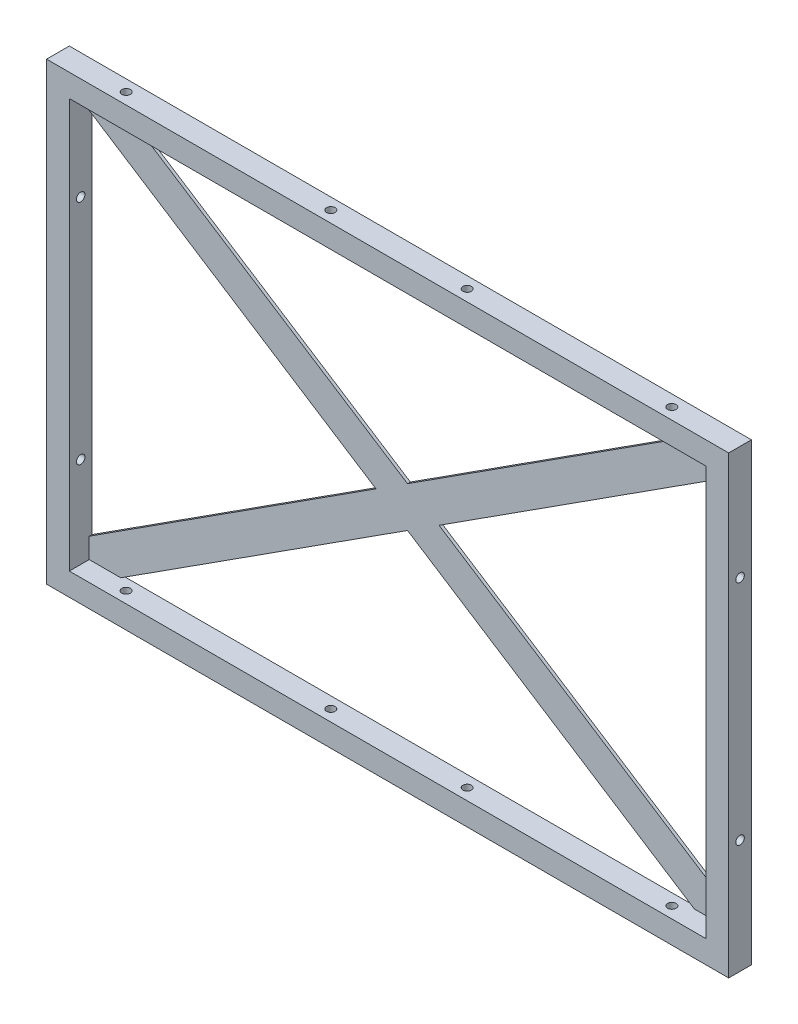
ISO-10303-21;
HEADER;
FILE_DESCRIPTION(('STEP AP214'),'2;1');
FILE_NAME('part.step','',(''),(''),'','','');
FILE_SCHEMA(('AUTOMOTIVE_DESIGN { 1 0 10303 214 1 1 1 1 }'));
ENDSEC;
DATA;
#1=APPLICATION_CONTEXT('core data for automotive mechanical design processes');
#2=APPLICATION_PROTOCOL_DEFINITION('international standard','automotive_design',2000,#1);
#3=PRODUCT_CONTEXT('',#1,'mechanical');
#4=PRODUCT('Part','Part','',(#3));
#5=PRODUCT_RELATED_PRODUCT_CATEGORY('part','',(#4));
#6=PRODUCT_DEFINITION_FORMATION('','',#4);
#7=PRODUCT_DEFINITION_CONTEXT('part definition',#1,'design');
#8=PRODUCT_DEFINITION('design','',#6,#7);
#9=PRODUCT_DEFINITION_SHAPE('','',#8);
#10=(LENGTH_UNIT() NAMED_UNIT(*) SI_UNIT(.MILLI.,.METRE.));
#11=(NAMED_UNIT(*) PLANE_ANGLE_UNIT() SI_UNIT($,.RADIAN.));
#12=(NAMED_UNIT(*) SI_UNIT($,.STERADIAN.) SOLID_ANGLE_UNIT());
#13=UNCERTAINTY_MEASURE_WITH_UNIT(LENGTH_MEASURE(1.E-05),#10,'distance_accuracy_value','');
#14=(GEOMETRIC_REPRESENTATION_CONTEXT(3) GLOBAL_UNCERTAINTY_ASSIGNED_CONTEXT((#13)) GLOBAL_UNIT_ASSIGNED_CONTEXT((#10,
#11,#12)) REPRESENTATION_CONTEXT('',''));
#15=CARTESIAN_POINT('',(0.,0.,0.));
#16=DIRECTION('',(0.,0.,1.));
#17=DIRECTION('',(1.,0.,0.));
#18=AXIS2_PLACEMENT_3D('',#15,#16,#17);
#19=CARTESIAN_POINT('',(381.000000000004,-253.999999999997,25.4));
#20=DIRECTION('',(0.,1.,0.));
#21=DIRECTION('',(0.,0.,1.));
#22=AXIS2_PLACEMENT_3D('',#19,#20,#21);
#23=PLANE('',#22);
#24=CARTESIAN_POINT('',(76.2,-253.999999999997,12.7));
#25=DIRECTION('',(0.,-1.,0.));
#26=DIRECTION('',(0.,0.,-1.));
#27=AXIS2_PLACEMENT_3D('',#24,#25,#26);
#28=CIRCLE('',#27,4.76249999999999);
#29=CARTESIAN_POINT('',(76.2,-253.999999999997,7.93750000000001));
#30=VERTEX_POINT('',#29);
#31=EDGE_CURVE('E299',#30,#30,#28,.T.);
#32=ORIENTED_EDGE('',*,*,#31,.F.);
#33=EDGE_LOOP('',(#32));
#34=FACE_BOUND('',#33,.T.);
#35=CARTESIAN_POINT('',(304.800000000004,-253.999999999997,12.7));
#36=DIRECTION('',(0.,-1.,0.));
#37=DIRECTION('',(0.,0.,-1.));
#38=AXIS2_PLACEMENT_3D('',#35,#36,#37);
#39=CIRCLE('',#38,4.7625);
#40=CARTESIAN_POINT('',(304.800000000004,-253.999999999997,7.9375));
#41=VERTEX_POINT('',#40);
#42=EDGE_CURVE('E288',#41,#41,#39,.T.);
#43=ORIENTED_EDGE('',*,*,#42,.F.);
#44=EDGE_LOOP('',(#43));
#45=FACE_BOUND('',#44,.T.);
#46=DIRECTION('',(1.,0.,0.));
#47=VECTOR('',#46,1.);
#48=CARTESIAN_POINT('',(381.000000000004,-253.999999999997,0.));
#49=LINE('',#48,#47);
#50=CARTESIAN_POINT('',(-381.000000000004,-253.999999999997,0.));
#51=VERTEX_POINT('',#50);
#52=CARTESIAN_POINT('',(381.000000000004,-253.999999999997,0.));
#53=VERTEX_POINT('',#52);
#54=EDGE_CURVE('E394',#51,#53,#49,.T.);
#55=ORIENTED_EDGE('',*,*,#54,.T.);
#56=DIRECTION('',(0.,0.,-1.));
#57=VECTOR('',#56,1.);
#58=CARTESIAN_POINT('',(381.000000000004,-253.999999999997,25.4));
#59=LINE('',#58,#57);
#60=CARTESIAN_POINT('',(381.000000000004,-253.999999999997,25.4));
#61=VERTEX_POINT('',#60);
#62=EDGE_CURVE('E380',#61,#53,#59,.T.);
#63=ORIENTED_EDGE('',*,*,#62,.F.);
#64=DIRECTION('',(1.,0.,0.));
#65=VECTOR('',#64,1.);
#66=CARTESIAN_POINT('',(381.000000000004,-253.999999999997,25.4));
#67=LINE('',#66,#65);
#68=CARTESIAN_POINT('',(-381.000000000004,-253.999999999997,25.4));
#69=VERTEX_POINT('',#68);
#70=EDGE_CURVE('E400',#69,#61,#67,.T.);
#71=ORIENTED_EDGE('',*,*,#70,.F.);
#72=DIRECTION('',(0.,0.,-1.));
#73=VECTOR('',#72,1.);
#74=CARTESIAN_POINT('',(-381.000000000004,-253.999999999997,25.4));
#75=LINE('',#74,#73);
#76=EDGE_CURVE('E358',#69,#51,#75,.T.);
#77=ORIENTED_EDGE('',*,*,#76,.T.);
#78=EDGE_LOOP('',(#55,#63,#71,#77));
#79=FACE_BOUND('',#78,.T.);
#80=CARTESIAN_POINT('',(-304.800000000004,-253.999999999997,12.7));
#81=DIRECTION('',(0.,-1.,0.));
#82=DIRECTION('',(0.,0.,-1.));
#83=AXIS2_PLACEMENT_3D('',#80,#81,#82);
#84=CIRCLE('',#83,4.7625);
#85=CARTESIAN_POINT('',(-304.800000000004,-253.999999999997,7.9375));
#86=VERTEX_POINT('',#85);
#87=EDGE_CURVE('E304',#86,#86,#84,.T.);
#88=ORIENTED_EDGE('',*,*,#87,.F.);
#89=EDGE_LOOP('',(#88));
#90=FACE_BOUND('',#89,.T.);
#91=CARTESIAN_POINT('',(-76.2,-253.999999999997,12.7));
#92=DIRECTION('',(0.,-1.,0.));
#93=DIRECTION('',(0.,0.,-1.));
#94=AXIS2_PLACEMENT_3D('',#91,#92,#93);
#95=CIRCLE('',#94,4.76249999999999);
#96=CARTESIAN_POINT('',(-76.2,-253.999999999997,7.93750000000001));
#97=VERTEX_POINT('',#96);
#98=EDGE_CURVE('E287',#97,#97,#95,.T.);
#99=ORIENTED_EDGE('',*,*,#98,.F.);
#100=EDGE_LOOP('',(#99));
#101=FACE_BOUND('',#100,.T.);
#102=ADVANCED_FACE('F39',(#34,#45,#79,#90,#101),#23,.F.);
#103=CARTESIAN_POINT('',(381.000000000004,253.999999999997,25.4));
#104=DIRECTION('',(0.,-1.,0.));
#105=DIRECTION('',(0.,0.,-1.));
#106=AXIS2_PLACEMENT_3D('',#103,#104,#105);
#107=PLANE('',#106);
#108=DIRECTION('',(-1.,0.,0.));
#109=VECTOR('',#108,1.);
#110=CARTESIAN_POINT('',(381.000000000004,253.999999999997,0.));
#111=LINE('',#110,#109);
#112=CARTESIAN_POINT('',(381.000000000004,253.999999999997,0.));
#113=VERTEX_POINT('',#112);
#114=CARTESIAN_POINT('',(-381.000000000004,253.999999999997,0.));
#115=VERTEX_POINT('',#114);
#116=EDGE_CURVE('E390',#113,#115,#111,.T.);
#117=ORIENTED_EDGE('',*,*,#116,.T.);
#118=DIRECTION('',(0.,0.,-1.));
#119=VECTOR('',#118,1.);
#120=CARTESIAN_POINT('',(-381.000000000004,253.999999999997,25.4));
#121=LINE('',#120,#119);
#122=CARTESIAN_POINT('',(-381.000000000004,253.999999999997,25.4));
#123=VERTEX_POINT('',#122);
#124=EDGE_CURVE('E386',#123,#115,#121,.T.);
#125=ORIENTED_EDGE('',*,*,#124,.F.);
#126=DIRECTION('',(-1.,0.,0.));
#127=VECTOR('',#126,1.);
#128=CARTESIAN_POINT('',(381.000000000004,253.999999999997,25.4));
#129=LINE('',#128,#127);
#130=CARTESIAN_POINT('',(381.000000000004,253.999999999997,25.4));
#131=VERTEX_POINT('',#130);
#132=EDGE_CURVE('E389',#131,#123,#129,.T.);
#133=ORIENTED_EDGE('',*,*,#132,.F.);
#134=DIRECTION('',(0.,0.,-1.));
#135=VECTOR('',#134,1.);
#136=CARTESIAN_POINT('',(381.000000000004,253.999999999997,25.4));
#137=LINE('',#136,#135);
#138=EDGE_CURVE('E383',#131,#113,#137,.T.);
#139=ORIENTED_EDGE('',*,*,#138,.T.);
#140=EDGE_LOOP('',(#117,#125,#133,#139));
#141=FACE_BOUND('',#140,.T.);
#142=CARTESIAN_POINT('',(-304.800000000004,253.999999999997,12.7));
#143=DIRECTION('',(0.,1.,0.));
#144=DIRECTION('',(0.,0.,1.));
#145=AXIS2_PLACEMENT_3D('',#142,#143,#144);
#146=CIRCLE('',#145,4.7625);
#147=CARTESIAN_POINT('',(-304.800000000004,253.999999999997,17.4625));
#148=VERTEX_POINT('',#147);
#149=EDGE_CURVE('E328',#148,#148,#146,.T.);
#150=ORIENTED_EDGE('',*,*,#149,.F.);
#151=EDGE_LOOP('',(#150));
#152=FACE_BOUND('',#151,.T.);
#153=CARTESIAN_POINT('',(-76.2,253.999999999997,12.7));
#154=DIRECTION('',(0.,1.,0.));
#155=DIRECTION('',(0.,0.,1.));
#156=AXIS2_PLACEMENT_3D('',#153,#154,#155);
#157=CIRCLE('',#156,4.76249999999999);
#158=CARTESIAN_POINT('',(-76.2,253.999999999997,17.4625));
#159=VERTEX_POINT('',#158);
#160=EDGE_CURVE('E322',#159,#159,#157,.T.);
#161=ORIENTED_EDGE('',*,*,#160,.F.);
#162=EDGE_LOOP('',(#161));
#163=FACE_BOUND('',#162,.T.);
#164=CARTESIAN_POINT('',(304.800000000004,253.999999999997,12.7));
#165=DIRECTION('',(0.,1.,0.));
#166=DIRECTION('',(0.,0.,1.));
#167=AXIS2_PLACEMENT_3D('',#164,#165,#166);
#168=CIRCLE('',#167,4.7625);
#169=CARTESIAN_POINT('',(304.800000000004,253.999999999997,17.4625));
#170=VERTEX_POINT('',#169);
#171=EDGE_CURVE('E316',#170,#170,#168,.T.);
#172=ORIENTED_EDGE('',*,*,#171,.F.);
#173=EDGE_LOOP('',(#172));
#174=FACE_BOUND('',#173,.T.);
#175=CARTESIAN_POINT('',(76.2,253.999999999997,12.7));
#176=DIRECTION('',(0.,1.,0.));
#177=DIRECTION('',(0.,0.,1.));
#178=AXIS2_PLACEMENT_3D('',#175,#176,#177);
#179=CIRCLE('',#178,4.76249999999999);
#180=CARTESIAN_POINT('',(76.2,253.999999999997,17.4625));
#181=VERTEX_POINT('',#180);
#182=EDGE_CURVE('E310',#181,#181,#179,.T.);
#183=ORIENTED_EDGE('',*,*,#182,.F.);
#184=EDGE_LOOP('',(#183));
#185=FACE_BOUND('',#184,.T.);
#186=ADVANCED_FACE('F421',(#141,#152,#163,#174,#185),#107,.F.);
#187=CARTESIAN_POINT('',(355.6,228.6,25.4));
#188=DIRECTION('',(0.,-1.,0.));
#189=DIRECTION('',(0.,0.,-1.));
#190=AXIS2_PLACEMENT_3D('',#187,#188,#189);
#191=PLANE('',#190);
#192=CARTESIAN_POINT('',(304.800000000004,228.6,12.7));
#193=DIRECTION('',(0.,-1.,0.));
#194=DIRECTION('',(0.,0.,-1.));
#195=AXIS2_PLACEMENT_3D('',#192,#193,#194);
#196=CIRCLE('',#195,4.7625);
#197=CARTESIAN_POINT('',(304.800000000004,228.6,7.9375));
#198=VERTEX_POINT('',#197);
#199=EDGE_CURVE('E319',#198,#198,#196,.F.);
#200=ORIENTED_EDGE('',*,*,#199,.T.);
#201=EDGE_LOOP('',(#200));
#202=FACE_BOUND('',#201,.T.);
#203=CARTESIAN_POINT('',(-304.800000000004,228.6,12.7));
#204=DIRECTION('',(0.,-1.,0.));
#205=DIRECTION('',(0.,0.,-1.));
#206=AXIS2_PLACEMENT_3D('',#203,#204,#205);
#207=CIRCLE('',#206,4.76249999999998);
#208=CARTESIAN_POINT('',(-304.800000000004,228.6,7.93750000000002));
#209=VERTEX_POINT('',#208);
#210=EDGE_CURVE('E331',#209,#209,#207,.F.);
#211=ORIENTED_EDGE('',*,*,#210,.T.);
#212=EDGE_LOOP('',(#211));
#213=FACE_BOUND('',#212,.T.);
#214=DIRECTION('',(0.,0.,-1.));
#215=VECTOR('',#214,1.);
#216=CARTESIAN_POINT('',(320.371645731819,228.6,3.175));
#217=LINE('',#216,#215);
#218=CARTESIAN_POINT('',(320.371645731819,228.6,3.175));
#219=VERTEX_POINT('',#218);
#220=CARTESIAN_POINT('',(320.371645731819,228.6,0.));
#221=VERTEX_POINT('',#220);
#222=EDGE_CURVE('E227',#219,#221,#217,.T.);
#223=ORIENTED_EDGE('',*,*,#222,.F.);
#224=DIRECTION('',(1.,0.,0.));
#225=VECTOR('',#224,1.);
#226=CARTESIAN_POINT('',(0.,228.6,3.175));
#227=LINE('',#226,#225);
#228=CARTESIAN_POINT('',(355.6,228.6,3.175));
#229=VERTEX_POINT('',#228);
#230=EDGE_CURVE('E187',#219,#229,#227,.T.);
#231=ORIENTED_EDGE('',*,*,#230,.T.);
#232=DIRECTION('',(0.,0.,-1.));
#233=VECTOR('',#232,1.);
#234=CARTESIAN_POINT('',(355.6,228.6,25.4));
#235=LINE('',#234,#233);
#236=CARTESIAN_POINT('',(355.6,228.6,25.4));
#237=VERTEX_POINT('',#236);
#238=EDGE_CURVE('E178',#237,#229,#235,.T.);
#239=ORIENTED_EDGE('',*,*,#238,.F.);
#240=DIRECTION('',(-1.,0.,0.));
#241=VECTOR('',#240,1.);
#242=CARTESIAN_POINT('',(355.6,228.6,25.4));
#243=LINE('',#242,#241);
#244=CARTESIAN_POINT('',(-355.6,228.6,25.4));
#245=VERTEX_POINT('',#244);
#246=EDGE_CURVE('E185',#237,#245,#243,.T.);
#247=ORIENTED_EDGE('',*,*,#246,.T.);
#248=DIRECTION('',(0.,0.,-1.));
#249=VECTOR('',#248,1.);
#250=CARTESIAN_POINT('',(-355.6,228.6,25.4));
#251=LINE('',#250,#249);
#252=CARTESIAN_POINT('',(-355.6,228.6,3.175));
#253=VERTEX_POINT('',#252);
#254=EDGE_CURVE('E189',#245,#253,#251,.T.);
#255=ORIENTED_EDGE('',*,*,#254,.T.);
#256=DIRECTION('',(1.,0.,0.));
#257=VECTOR('',#256,1.);
#258=CARTESIAN_POINT('',(0.,228.6,3.175));
#259=LINE('',#258,#257);
#260=CARTESIAN_POINT('',(-320.371645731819,228.6,3.175));
#261=VERTEX_POINT('',#260);
#262=EDGE_CURVE('E48',#253,#261,#259,.T.);
#263=ORIENTED_EDGE('',*,*,#262,.T.);
#264=DIRECTION('',(0.,0.,-1.));
#265=VECTOR('',#264,1.);
#266=CARTESIAN_POINT('',(-320.371645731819,228.6,3.175));
#267=LINE('',#266,#265);
#268=CARTESIAN_POINT('',(-320.371645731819,228.6,0.));
#269=VERTEX_POINT('',#268);
#270=EDGE_CURVE('E11',#261,#269,#267,.T.);
#271=ORIENTED_EDGE('',*,*,#270,.T.);
#272=DIRECTION('',(-1.,0.,0.));
#273=VECTOR('',#272,1.);
#274=CARTESIAN_POINT('',(355.6,228.6,0.));
#275=LINE('',#274,#273);
#276=EDGE_CURVE('E214',#221,#269,#275,.T.);
#277=ORIENTED_EDGE('',*,*,#276,.F.);
#278=EDGE_LOOP('',(#223,#231,#239,#247,#255,#263,#271,#277));
#279=FACE_BOUND('',#278,.T.);
#280=CARTESIAN_POINT('',(-76.2,228.6,12.7));
#281=DIRECTION('',(0.,-1.,0.));
#282=DIRECTION('',(0.,0.,-1.));
#283=AXIS2_PLACEMENT_3D('',#280,#281,#282);
#284=CIRCLE('',#283,4.76249999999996);
#285=CARTESIAN_POINT('',(-76.2,228.6,7.93750000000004));
#286=VERTEX_POINT('',#285);
#287=EDGE_CURVE('E325',#286,#286,#284,.F.);
#288=ORIENTED_EDGE('',*,*,#287,.T.);
#289=EDGE_LOOP('',(#288));
#290=FACE_BOUND('',#289,.T.);
#291=CARTESIAN_POINT('',(76.2,228.6,12.7));
#292=DIRECTION('',(0.,-1.,0.));
#293=DIRECTION('',(0.,0.,-1.));
#294=AXIS2_PLACEMENT_3D('',#291,#292,#293);
#295=CIRCLE('',#294,4.76249999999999);
#296=CARTESIAN_POINT('',(76.2,228.6,7.93750000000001));
#297=VERTEX_POINT('',#296);
#298=EDGE_CURVE('E313',#297,#297,#295,.F.);
#299=ORIENTED_EDGE('',*,*,#298,.T.);
#300=EDGE_LOOP('',(#299));
#301=FACE_BOUND('',#300,.T.);
#302=ADVANCED_FACE('F181',(#202,#213,#279,#290,#301),#191,.T.);
#303=CARTESIAN_POINT('',(381.000000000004,-253.999999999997,25.4));
#304=DIRECTION('',(-1.,0.,0.));
#305=DIRECTION('',(0.,0.,1.));
#306=AXIS2_PLACEMENT_3D('',#303,#304,#305);
#307=PLANE('',#306);
#308=DIRECTION('',(0.,1.,0.));
#309=VECTOR('',#308,1.);
#310=CARTESIAN_POINT('',(381.000000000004,-253.999999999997,0.));
#311=LINE('',#310,#309);
#312=EDGE_CURVE('E392',#53,#113,#311,.T.);
#313=ORIENTED_EDGE('',*,*,#312,.T.);
#314=ORIENTED_EDGE('',*,*,#138,.F.);
#315=DIRECTION('',(0.,1.,0.));
#316=VECTOR('',#315,1.);
#317=CARTESIAN_POINT('',(381.000000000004,-253.999999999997,25.4));
#318=LINE('',#317,#316);
#319=EDGE_CURVE('E399',#61,#131,#318,.T.);
#320=ORIENTED_EDGE('',*,*,#319,.F.);
#321=ORIENTED_EDGE('',*,*,#62,.T.);
#322=EDGE_LOOP('',(#313,#314,#320,#321));
#323=FACE_BOUND('',#322,.T.);
#324=CARTESIAN_POINT('',(381.000000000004,126.999999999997,12.7));
#325=DIRECTION('',(1.,0.,0.));
#326=DIRECTION('',(0.,0.,-1.));
#327=AXIS2_PLACEMENT_3D('',#324,#325,#326);
#328=CIRCLE('',#327,4.7625);
#329=CARTESIAN_POINT('',(381.000000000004,126.999999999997,7.9375));
#330=VERTEX_POINT('',#329);
#331=EDGE_CURVE('E340',#330,#330,#328,.T.);
#332=ORIENTED_EDGE('',*,*,#331,.F.);
#333=EDGE_LOOP('',(#332));
#334=FACE_BOUND('',#333,.T.);
#335=CARTESIAN_POINT('',(381.000000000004,-126.999999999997,12.7));
#336=DIRECTION('',(1.,0.,0.));
#337=DIRECTION('',(0.,0.,-1.));
#338=AXIS2_PLACEMENT_3D('',#335,#336,#337);
#339=CIRCLE('',#338,4.76249999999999);
#340=CARTESIAN_POINT('',(381.000000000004,-126.999999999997,7.93750000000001));
#341=VERTEX_POINT('',#340);
#342=EDGE_CURVE('E334',#341,#341,#339,.T.);
#343=ORIENTED_EDGE('',*,*,#342,.F.);
#344=EDGE_LOOP('',(#343));
#345=FACE_BOUND('',#344,.T.);
#346=ADVANCED_FACE('F417',(#323,#334,#345),#307,.F.);
#347=CARTESIAN_POINT('',(-355.6,-228.6,25.4));
#348=DIRECTION('',(1.,0.,0.));
#349=DIRECTION('',(0.,0.,-1.));
#350=AXIS2_PLACEMENT_3D('',#347,#348,#349);
#351=PLANE('',#350);
#352=CARTESIAN_POINT('',(-355.6,126.999999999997,12.7));
#353=DIRECTION('',(1.,0.,0.));
#354=DIRECTION('',(0.,0.,-1.));
#355=AXIS2_PLACEMENT_3D('',#352,#353,#354);
#356=CIRCLE('',#355,4.76249999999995);
#357=CARTESIAN_POINT('',(-355.6,126.999999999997,7.93750000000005));
#358=VERTEX_POINT('',#357);
#359=EDGE_CURVE('E355',#358,#358,#356,.F.);
#360=ORIENTED_EDGE('',*,*,#359,.T.);
#361=EDGE_LOOP('',(#360));
#362=FACE_BOUND('',#361,.T.);
#363=DIRECTION('',(0.,0.,-1.));
#364=VECTOR('',#363,1.);
#365=CARTESIAN_POINT('',(-355.6,205.953200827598,3.175));
#366=LINE('',#365,#364);
#367=CARTESIAN_POINT('',(-355.6,205.953200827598,3.175));
#368=VERTEX_POINT('',#367);
#369=CARTESIAN_POINT('',(-355.6,205.953200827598,0.));
#370=VERTEX_POINT('',#369);
#371=EDGE_CURVE('E273',#368,#370,#366,.T.);
#372=ORIENTED_EDGE('',*,*,#371,.F.);
#373=DIRECTION('',(0.,-1.,0.));
#374=VECTOR('',#373,1.);
#375=CARTESIAN_POINT('',(-355.6,0.,3.175));
#376=LINE('',#375,#374);
#377=EDGE_CURVE('E270',#253,#368,#376,.T.);
#378=ORIENTED_EDGE('',*,*,#377,.F.);
#379=ORIENTED_EDGE('',*,*,#254,.F.);
#380=DIRECTION('',(0.,-1.,0.));
#381=VECTOR('',#380,1.);
#382=CARTESIAN_POINT('',(-355.6,-228.6,25.4));
#383=LINE('',#382,#381);
#384=CARTESIAN_POINT('',(-355.6,-228.6,25.4));
#385=VERTEX_POINT('',#384);
#386=EDGE_CURVE('E205',#245,#385,#383,.T.);
#387=ORIENTED_EDGE('',*,*,#386,.T.);
#388=DIRECTION('',(0.,0.,-1.));
#389=VECTOR('',#388,1.);
#390=CARTESIAN_POINT('',(-355.6,-228.6,25.4));
#391=LINE('',#390,#389);
#392=CARTESIAN_POINT('',(-355.6,-228.6,3.175));
#393=VERTEX_POINT('',#392);
#394=EDGE_CURVE('E359',#385,#393,#391,.T.);
#395=ORIENTED_EDGE('',*,*,#394,.T.);
#396=DIRECTION('',(0.,-1.,0.));
#397=VECTOR('',#396,1.);
#398=CARTESIAN_POINT('',(-355.6,0.,3.175));
#399=LINE('',#398,#397);
#400=CARTESIAN_POINT('',(-355.6,-205.953200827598,3.175));
#401=VERTEX_POINT('',#400);
#402=EDGE_CURVE('E278',#401,#393,#399,.T.);
#403=ORIENTED_EDGE('',*,*,#402,.F.);
#404=DIRECTION('',(0.,0.,-1.));
#405=VECTOR('',#404,1.);
#406=CARTESIAN_POINT('',(-355.6,-205.953200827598,3.175));
#407=LINE('',#406,#405);
#408=CARTESIAN_POINT('',(-355.6,-205.953200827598,0.));
#409=VERTEX_POINT('',#408);
#410=EDGE_CURVE('E483',#401,#409,#407,.T.);
#411=ORIENTED_EDGE('',*,*,#410,.T.);
#412=DIRECTION('',(0.,-1.,0.));
#413=VECTOR('',#412,1.);
#414=CARTESIAN_POINT('',(-355.6,-228.6,0.));
#415=LINE('',#414,#413);
#416=EDGE_CURVE('E220',#370,#409,#415,.T.);
#417=ORIENTED_EDGE('',*,*,#416,.F.);
#418=EDGE_LOOP('',(#372,#378,#379,#387,#395,#403,#411,#417));
#419=FACE_BOUND('',#418,.T.);
#420=CARTESIAN_POINT('',(-355.6,-126.999999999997,12.7));
#421=DIRECTION('',(1.,0.,0.));
#422=DIRECTION('',(0.,0.,-1.));
#423=AXIS2_PLACEMENT_3D('',#420,#421,#422);
#424=CIRCLE('',#423,4.76249999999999);
#425=CARTESIAN_POINT('',(-355.6,-126.999999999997,7.93750000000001));
#426=VERTEX_POINT('',#425);
#427=EDGE_CURVE('E349',#426,#426,#424,.F.);
#428=ORIENTED_EDGE('',*,*,#427,.T.);
#429=EDGE_LOOP('',(#428));
#430=FACE_BOUND('',#429,.T.);
#431=ADVANCED_FACE('F430',(#362,#419,#430),#351,.T.);
#432=CARTESIAN_POINT('',(0.,0.,3.175));
#433=DIRECTION('',(0.,0.,1.));
#434=DIRECTION('',(1.,0.,0.));
#435=AXIS2_PLACEMENT_3D('',#432,#433,#434);
#436=PLANE('',#435);
#437=ORIENTED_EDGE('',*,*,#402,.T.);
#438=DIRECTION('',(1.,0.,0.));
#439=VECTOR('',#438,1.);
#440=CARTESIAN_POINT('',(7.20433834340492E-13,-228.599999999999,3.175));
#441=LINE('',#440,#439);
#442=CARTESIAN_POINT('',(-320.371645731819,-228.6,3.175));
#443=VERTEX_POINT('',#442);
#444=EDGE_CURVE('E477',#393,#443,#441,.T.);
#445=ORIENTED_EDGE('',*,*,#444,.T.);
#446=DIRECTION('',(0.841178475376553,0.540757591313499,0.));
#447=VECTOR('',#446,1.);
#448=CARTESIAN_POINT('',(10.3014321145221,-16.0244499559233,3.175));
#449=LINE('',#448,#447);
#450=CARTESIAN_POINT('',(0.,-22.6467991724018,3.175));
#451=VERTEX_POINT('',#450);
#452=EDGE_CURVE('E528',#443,#451,#449,.T.);
#453=ORIENTED_EDGE('',*,*,#452,.T.);
#454=DIRECTION('',(0.841178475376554,-0.540757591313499,0.));
#455=VECTOR('',#454,1.);
#456=CARTESIAN_POINT('',(-10.3014321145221,-16.0244499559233,3.175));
#457=LINE('',#456,#455);
#458=CARTESIAN_POINT('',(320.371645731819,-228.6,3.175));
#459=VERTEX_POINT('',#458);
#460=EDGE_CURVE('E507',#451,#459,#457,.T.);
#461=ORIENTED_EDGE('',*,*,#460,.T.);
#462=DIRECTION('',(-1.,0.,0.));
#463=VECTOR('',#462,1.);
#464=CARTESIAN_POINT('',(0.,-228.6,3.175));
#465=LINE('',#464,#463);
#466=CARTESIAN_POINT('',(355.6,-228.6,3.175));
#467=VERTEX_POINT('',#466);
#468=EDGE_CURVE('E493',#467,#459,#465,.T.);
#469=ORIENTED_EDGE('',*,*,#468,.F.);
#470=DIRECTION('',(0.,-1.,0.));
#471=VECTOR('',#470,1.);
#472=CARTESIAN_POINT('',(355.6,0.,3.175));
#473=LINE('',#472,#471);
#474=CARTESIAN_POINT('',(355.6,-205.953200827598,3.175));
#475=VERTEX_POINT('',#474);
#476=EDGE_CURVE('E498',#475,#467,#473,.T.);
#477=ORIENTED_EDGE('',*,*,#476,.F.);
#478=DIRECTION('',(0.841178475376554,-0.540757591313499,0.));
#479=VECTOR('',#478,1.);
#480=CARTESIAN_POINT('',(10.3014321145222,16.0244499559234,3.175));
#481=LINE('',#480,#479);
#482=CARTESIAN_POINT('',(35.2283542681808,0.,3.175));
#483=VERTEX_POINT('',#482);
#484=EDGE_CURVE('E511',#483,#475,#481,.T.);
#485=ORIENTED_EDGE('',*,*,#484,.F.);
#486=DIRECTION('',(0.841178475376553,0.540757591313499,0.));
#487=VECTOR('',#486,1.);
#488=CARTESIAN_POINT('',(10.3014321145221,-16.0244499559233,3.175));
#489=LINE('',#488,#487);
#490=CARTESIAN_POINT('',(355.6,205.953200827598,3.175));
#491=VERTEX_POINT('',#490);
#492=EDGE_CURVE('E261',#483,#491,#489,.T.);
#493=ORIENTED_EDGE('',*,*,#492,.T.);
#494=DIRECTION('',(0.,-1.,0.));
#495=VECTOR('',#494,1.);
#496=CARTESIAN_POINT('',(355.6,0.,3.175));
#497=LINE('',#496,#495);
#498=EDGE_CURVE('E63',#229,#491,#497,.T.);
#499=ORIENTED_EDGE('',*,*,#498,.F.);
#500=ORIENTED_EDGE('',*,*,#230,.F.);
#501=DIRECTION('',(0.841178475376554,0.540757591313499,0.));
#502=VECTOR('',#501,1.);
#503=CARTESIAN_POINT('',(-10.3014321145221,16.0244499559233,3.175));
#504=LINE('',#503,#502);
#505=CARTESIAN_POINT('',(0.,22.6467991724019,3.175));
#506=VERTEX_POINT('',#505);
#507=EDGE_CURVE('E257',#506,#219,#504,.T.);
#508=ORIENTED_EDGE('',*,*,#507,.F.);
#509=DIRECTION('',(0.841178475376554,-0.540757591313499,0.));
#510=VECTOR('',#509,1.);
#511=CARTESIAN_POINT('',(10.3014321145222,16.0244499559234,3.175));
#512=LINE('',#511,#510);
#513=EDGE_CURVE('E260',#261,#506,#512,.T.);
#514=ORIENTED_EDGE('',*,*,#513,.F.);
#515=ORIENTED_EDGE('',*,*,#262,.F.);
#516=ORIENTED_EDGE('',*,*,#377,.T.);
#517=DIRECTION('',(0.841178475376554,-0.540757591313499,0.));
#518=VECTOR('',#517,1.);
#519=CARTESIAN_POINT('',(-10.3014321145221,-16.0244499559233,3.175));
#520=LINE('',#519,#518);
#521=CARTESIAN_POINT('',(-35.2283542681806,0.,3.175));
#522=VERTEX_POINT('',#521);
#523=EDGE_CURVE('E263',#368,#522,#520,.T.);
#524=ORIENTED_EDGE('',*,*,#523,.T.);
#525=DIRECTION('',(0.841178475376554,0.540757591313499,0.));
#526=VECTOR('',#525,1.);
#527=CARTESIAN_POINT('',(-10.3014321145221,16.0244499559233,3.175));
#528=LINE('',#527,#526);
#529=EDGE_CURVE('E480',#401,#522,#528,.T.);
#530=ORIENTED_EDGE('',*,*,#529,.F.);
#531=EDGE_LOOP('',(#437,#445,#453,#461,#469,#477,#485,#493,#499,#500,#508,#514,#515,#516,#524,#530));
#532=FACE_BOUND('',#531,.T.);
#533=ADVANCED_FACE('F443',(#532),#436,.T.);
#534=CARTESIAN_POINT('',(10.3014321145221,-16.0244499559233,3.175));
#535=DIRECTION('',(-0.540757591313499,0.841178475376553,0.));
#536=DIRECTION('',(-0.841178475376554,-0.540757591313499,0.));
#537=AXIS2_PLACEMENT_3D('',#534,#535,#536);
#538=PLANE('',#537);
#539=DIRECTION('',(0.841178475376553,0.540757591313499,0.));
#540=VECTOR('',#539,1.);
#541=CARTESIAN_POINT('',(10.3014321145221,-16.0244499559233,0.));
#542=LINE('',#541,#540);
#543=CARTESIAN_POINT('',(-320.371645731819,-228.6,0.));
#544=VERTEX_POINT('',#543);
#545=CARTESIAN_POINT('',(0.,-22.6467991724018,0.));
#546=VERTEX_POINT('',#545);
#547=EDGE_CURVE('E224',#544,#546,#542,.T.);
#548=ORIENTED_EDGE('',*,*,#547,.T.);
#549=DIRECTION('',(0.,0.,-1.));
#550=VECTOR('',#549,1.);
#551=CARTESIAN_POINT('',(0.,-22.6467991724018,3.175));
#552=LINE('',#551,#550);
#553=EDGE_CURVE('E232',#451,#546,#552,.T.);
#554=ORIENTED_EDGE('',*,*,#553,.F.);
#555=ORIENTED_EDGE('',*,*,#452,.F.);
#556=DIRECTION('',(0.,0.,-1.));
#557=VECTOR('',#556,1.);
#558=CARTESIAN_POINT('',(-320.371645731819,-228.6,3.175));
#559=LINE('',#558,#557);
#560=EDGE_CURVE('E274',#443,#544,#559,.T.);
#561=ORIENTED_EDGE('',*,*,#560,.T.);
#562=EDGE_LOOP('',(#548,#554,#555,#561));
#563=FACE_BOUND('',#562,.T.);
#564=ADVANCED_FACE('F41',(#563),#538,.F.);
#565=CARTESIAN_POINT('',(-10.3014321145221,-16.0244499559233,3.175));
#566=DIRECTION('',(0.540757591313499,0.841178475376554,0.));
#567=DIRECTION('',(-0.841178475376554,0.540757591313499,0.));
#568=AXIS2_PLACEMENT_3D('',#565,#566,#567);
#569=PLANE('',#568);
#570=DIRECTION('',(0.841178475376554,-0.540757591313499,0.));
#571=VECTOR('',#570,1.);
#572=CARTESIAN_POINT('',(-10.3014321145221,-16.0244499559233,0.));
#573=LINE('',#572,#571);
#574=CARTESIAN_POINT('',(320.371645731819,-228.6,0.));
#575=VERTEX_POINT('',#574);
#576=EDGE_CURVE('E524',#546,#575,#573,.T.);
#577=ORIENTED_EDGE('',*,*,#576,.T.);
#578=DIRECTION('',(0.,0.,-1.));
#579=VECTOR('',#578,1.);
#580=CARTESIAN_POINT('',(320.371645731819,-228.6,3.175));
#581=LINE('',#580,#579);
#582=EDGE_CURVE('E494',#459,#575,#581,.T.);
#583=ORIENTED_EDGE('',*,*,#582,.F.);
#584=ORIENTED_EDGE('',*,*,#460,.F.);
#585=ORIENTED_EDGE('',*,*,#553,.T.);
#586=EDGE_LOOP('',(#577,#583,#584,#585));
#587=FACE_BOUND('',#586,.T.);
#588=ADVANCED_FACE('F472',(#587),#569,.F.);
#589=CARTESIAN_POINT('',(10.3014321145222,16.0244499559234,3.175));
#590=DIRECTION('',(0.540757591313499,0.841178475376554,0.));
#591=DIRECTION('',(-0.841178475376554,0.540757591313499,0.));
#592=AXIS2_PLACEMENT_3D('',#589,#590,#591);
#593=PLANE('',#592);
#594=DIRECTION('',(0.841178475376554,-0.540757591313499,0.));
#595=VECTOR('',#594,1.);
#596=CARTESIAN_POINT('',(10.3014321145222,16.0244499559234,0.));
#597=LINE('',#596,#595);
#598=CARTESIAN_POINT('',(35.2283542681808,0.,0.));
#599=VERTEX_POINT('',#598);
#600=CARTESIAN_POINT('',(355.6,-205.953200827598,0.));
#601=VERTEX_POINT('',#600);
#602=EDGE_CURVE('E520',#599,#601,#597,.T.);
#603=ORIENTED_EDGE('',*,*,#602,.F.);
#604=DIRECTION('',(0.,0.,-1.));
#605=VECTOR('',#604,1.);
#606=CARTESIAN_POINT('',(35.2283542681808,0.,3.175));
#607=LINE('',#606,#605);
#608=EDGE_CURVE('E242',#483,#599,#607,.T.);
#609=ORIENTED_EDGE('',*,*,#608,.F.);
#610=ORIENTED_EDGE('',*,*,#484,.T.);
#611=DIRECTION('',(0.,0.,-1.));
#612=VECTOR('',#611,1.);
#613=CARTESIAN_POINT('',(355.6,-205.953200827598,3.175));
#614=LINE('',#613,#612);
#615=EDGE_CURVE('E231',#475,#601,#614,.T.);
#616=ORIENTED_EDGE('',*,*,#615,.T.);
#617=EDGE_LOOP('',(#603,#609,#610,#616));
#618=FACE_BOUND('',#617,.T.);
#619=ADVANCED_FACE('F591',(#618),#593,.T.);
#620=CARTESIAN_POINT('',(10.3014321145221,-16.0244499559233,3.175));
#621=DIRECTION('',(-0.540757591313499,0.841178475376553,0.));
#622=DIRECTION('',(-0.841178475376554,-0.540757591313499,0.));
#623=AXIS2_PLACEMENT_3D('',#620,#621,#622);
#624=PLANE('',#623);
#625=DIRECTION('',(0.841178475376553,0.540757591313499,0.));
#626=VECTOR('',#625,1.);
#627=CARTESIAN_POINT('',(10.3014321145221,-16.0244499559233,0.));
#628=LINE('',#627,#626);
#629=CARTESIAN_POINT('',(355.6,205.953200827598,0.));
#630=VERTEX_POINT('',#629);
#631=EDGE_CURVE('E518',#599,#630,#628,.T.);
#632=ORIENTED_EDGE('',*,*,#631,.T.);
#633=DIRECTION('',(0.,0.,-1.));
#634=VECTOR('',#633,1.);
#635=CARTESIAN_POINT('',(355.6,205.953200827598,3.175));
#636=LINE('',#635,#634);
#637=EDGE_CURVE('E244',#491,#630,#636,.T.);
#638=ORIENTED_EDGE('',*,*,#637,.F.);
#639=ORIENTED_EDGE('',*,*,#492,.F.);
#640=ORIENTED_EDGE('',*,*,#608,.T.);
#641=EDGE_LOOP('',(#632,#638,#639,#640));
#642=FACE_BOUND('',#641,.T.);
#643=ADVANCED_FACE('F585',(#642),#624,.F.);
#644=CARTESIAN_POINT('',(-10.3014321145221,16.0244499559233,3.175));
#645=DIRECTION('',(-0.540757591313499,0.841178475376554,0.));
#646=DIRECTION('',(-0.841178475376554,-0.540757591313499,0.));
#647=AXIS2_PLACEMENT_3D('',#644,#645,#646);
#648=PLANE('',#647);
#649=DIRECTION('',(0.841178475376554,0.540757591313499,0.));
#650=VECTOR('',#649,1.);
#651=CARTESIAN_POINT('',(-10.3014321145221,16.0244499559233,0.));
#652=LINE('',#651,#650);
#653=CARTESIAN_POINT('',(0.,22.6467991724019,0.));
#654=VERTEX_POINT('',#653);
#655=EDGE_CURVE('E555',#654,#221,#652,.T.);
#656=ORIENTED_EDGE('',*,*,#655,.F.);
#657=DIRECTION('',(0.,0.,-1.));
#658=VECTOR('',#657,1.);
#659=CARTESIAN_POINT('',(0.,22.6467991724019,3.175));
#660=LINE('',#659,#658);
#661=EDGE_CURVE('E238',#506,#654,#660,.T.);
#662=ORIENTED_EDGE('',*,*,#661,.F.);
#663=ORIENTED_EDGE('',*,*,#507,.T.);
#664=ORIENTED_EDGE('',*,*,#222,.T.);
#665=EDGE_LOOP('',(#656,#662,#663,#664));
#666=FACE_BOUND('',#665,.T.);
#667=ADVANCED_FACE('F578',(#666),#648,.T.);
#668=CARTESIAN_POINT('',(10.3014321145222,16.0244499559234,3.175));
#669=DIRECTION('',(0.540757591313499,0.841178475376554,0.));
#670=DIRECTION('',(-0.841178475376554,0.540757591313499,0.));
#671=AXIS2_PLACEMENT_3D('',#668,#669,#670);
#672=PLANE('',#671);
#673=DIRECTION('',(0.841178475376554,-0.540757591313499,0.));
#674=VECTOR('',#673,1.);
#675=CARTESIAN_POINT('',(10.3014321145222,16.0244499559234,0.));
#676=LINE('',#675,#674);
#677=EDGE_CURVE('E56',#269,#654,#676,.T.);
#678=ORIENTED_EDGE('',*,*,#677,.F.);
#679=ORIENTED_EDGE('',*,*,#270,.F.);
#680=ORIENTED_EDGE('',*,*,#513,.T.);
#681=ORIENTED_EDGE('',*,*,#661,.T.);
#682=EDGE_LOOP('',(#678,#679,#680,#681));
#683=FACE_BOUND('',#682,.T.);
#684=ADVANCED_FACE('F576',(#683),#672,.T.);
#685=CARTESIAN_POINT('',(-10.3014321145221,-16.0244499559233,3.175));
#686=DIRECTION('',(0.540757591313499,0.841178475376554,0.));
#687=DIRECTION('',(-0.841178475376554,0.540757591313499,0.));
#688=AXIS2_PLACEMENT_3D('',#685,#686,#687);
#689=PLANE('',#688);
#690=DIRECTION('',(0.841178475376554,-0.540757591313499,0.));
#691=VECTOR('',#690,1.);
#692=CARTESIAN_POINT('',(-10.3014321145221,-16.0244499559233,0.));
#693=LINE('',#692,#691);
#694=CARTESIAN_POINT('',(-35.2283542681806,0.,0.));
#695=VERTEX_POINT('',#694);
#696=EDGE_CURVE('E532',#370,#695,#693,.T.);
#697=ORIENTED_EDGE('',*,*,#696,.T.);
#698=DIRECTION('',(0.,0.,-1.));
#699=VECTOR('',#698,1.);
#700=CARTESIAN_POINT('',(-35.2283542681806,0.,3.175));
#701=LINE('',#700,#699);
#702=EDGE_CURVE('E282',#522,#695,#701,.T.);
#703=ORIENTED_EDGE('',*,*,#702,.F.);
#704=ORIENTED_EDGE('',*,*,#523,.F.);
#705=ORIENTED_EDGE('',*,*,#371,.T.);
#706=EDGE_LOOP('',(#697,#703,#704,#705));
#707=FACE_BOUND('',#706,.T.);
#708=ADVANCED_FACE('F437',(#707),#689,.F.);
#709=CARTESIAN_POINT('',(-10.3014321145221,16.0244499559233,3.175));
#710=DIRECTION('',(-0.540757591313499,0.841178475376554,0.));
#711=DIRECTION('',(-0.841178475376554,-0.540757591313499,0.));
#712=AXIS2_PLACEMENT_3D('',#709,#710,#711);
#713=PLANE('',#712);
#714=DIRECTION('',(0.841178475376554,0.540757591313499,0.));
#715=VECTOR('',#714,1.);
#716=CARTESIAN_POINT('',(-10.3014321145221,16.0244499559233,0.));
#717=LINE('',#716,#715);
#718=EDGE_CURVE('E530',#409,#695,#717,.T.);
#719=ORIENTED_EDGE('',*,*,#718,.F.);
#720=ORIENTED_EDGE('',*,*,#410,.F.);
#721=ORIENTED_EDGE('',*,*,#529,.T.);
#722=ORIENTED_EDGE('',*,*,#702,.T.);
#723=EDGE_LOOP('',(#719,#720,#721,#722));
#724=FACE_BOUND('',#723,.T.);
#725=ADVANCED_FACE('F427',(#724),#713,.T.);
#726=CARTESIAN_POINT('',(0.,0.,0.));
#727=DIRECTION('',(0.,0.,1.));
#728=DIRECTION('',(1.,0.,0.));
#729=AXIS2_PLACEMENT_3D('',#726,#727,#728);
#730=PLANE('',#729);
#731=ORIENTED_EDGE('',*,*,#655,.T.);
#732=ORIENTED_EDGE('',*,*,#276,.T.);
#733=ORIENTED_EDGE('',*,*,#677,.T.);
#734=EDGE_LOOP('',(#731,#732,#733));
#735=FACE_BOUND('',#734,.T.);
#736=ORIENTED_EDGE('',*,*,#602,.T.);
#737=DIRECTION('',(0.,1.,0.));
#738=VECTOR('',#737,1.);
#739=CARTESIAN_POINT('',(355.6,-228.6,0.));
#740=LINE('',#739,#738);
#741=EDGE_CURVE('E371',#601,#630,#740,.T.);
#742=ORIENTED_EDGE('',*,*,#741,.T.);
#743=ORIENTED_EDGE('',*,*,#631,.F.);
#744=EDGE_LOOP('',(#736,#742,#743));
#745=FACE_BOUND('',#744,.T.);
#746=ORIENTED_EDGE('',*,*,#547,.F.);
#747=DIRECTION('',(1.,0.,0.));
#748=VECTOR('',#747,1.);
#749=CARTESIAN_POINT('',(355.6,-228.6,0.));
#750=LINE('',#749,#748);
#751=EDGE_CURVE('E225',#544,#575,#750,.T.);
#752=ORIENTED_EDGE('',*,*,#751,.T.);
#753=ORIENTED_EDGE('',*,*,#576,.F.);
#754=EDGE_LOOP('',(#746,#752,#753));
#755=FACE_BOUND('',#754,.T.);
#756=ORIENTED_EDGE('',*,*,#696,.F.);
#757=ORIENTED_EDGE('',*,*,#416,.T.);
#758=ORIENTED_EDGE('',*,*,#718,.T.);
#759=EDGE_LOOP('',(#756,#757,#758));
#760=FACE_BOUND('',#759,.T.);
#761=DIRECTION('',(0.,-1.,0.));
#762=VECTOR('',#761,1.);
#763=CARTESIAN_POINT('',(-381.000000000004,-253.999999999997,0.));
#764=LINE('',#763,#762);
#765=EDGE_CURVE('E363',#115,#51,#764,.T.);
#766=ORIENTED_EDGE('',*,*,#765,.F.);
#767=ORIENTED_EDGE('',*,*,#116,.F.);
#768=ORIENTED_EDGE('',*,*,#312,.F.);
#769=ORIENTED_EDGE('',*,*,#54,.F.);
#770=EDGE_LOOP('',(#766,#767,#768,#769));
#771=FACE_BOUND('',#770,.T.);
#772=ADVANCED_FACE('F424',(#735,#745,#755,#760,#771),#730,.F.);
#773=CARTESIAN_POINT('',(355.6,-228.6,25.4));
#774=DIRECTION('',(0.,1.,0.));
#775=DIRECTION('',(-1.,0.,0.));
#776=AXIS2_PLACEMENT_3D('',#773,#774,#775);
#777=PLANE('',#776);
#778=CARTESIAN_POINT('',(76.2,-228.6,12.7));
#779=DIRECTION('',(0.,1.,0.));
#780=DIRECTION('',(-1.,0.,0.));
#781=AXIS2_PLACEMENT_3D('',#778,#779,#780);
#782=CIRCLE('',#781,4.76249999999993);
#783=CARTESIAN_POINT('',(71.4375000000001,-228.6,12.7));
#784=VERTEX_POINT('',#783);
#785=EDGE_CURVE('E43',#784,#784,#782,.T.);
#786=ORIENTED_EDGE('',*,*,#785,.F.);
#787=EDGE_LOOP('',(#786));
#788=FACE_BOUND('',#787,.T.);
#789=CARTESIAN_POINT('',(304.800000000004,-228.6,12.7));
#790=DIRECTION('',(0.,1.,0.));
#791=DIRECTION('',(-1.,0.,0.));
#792=AXIS2_PLACEMENT_3D('',#789,#790,#791);
#793=CIRCLE('',#792,4.76249999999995);
#794=CARTESIAN_POINT('',(300.037500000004,-228.6,12.7));
#795=VERTEX_POINT('',#794);
#796=EDGE_CURVE('E285',#795,#795,#793,.T.);
#797=ORIENTED_EDGE('',*,*,#796,.F.);
#798=EDGE_LOOP('',(#797));
#799=FACE_BOUND('',#798,.T.);
#800=CARTESIAN_POINT('',(-76.2,-228.6,12.7));
#801=DIRECTION('',(0.,1.,0.));
#802=DIRECTION('',(-1.,0.,0.));
#803=AXIS2_PLACEMENT_3D('',#800,#801,#802);
#804=CIRCLE('',#803,4.76249999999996);
#805=CARTESIAN_POINT('',(-80.9625,-228.6,12.7));
#806=VERTEX_POINT('',#805);
#807=EDGE_CURVE('E292',#806,#806,#804,.T.);
#808=ORIENTED_EDGE('',*,*,#807,.F.);
#809=EDGE_LOOP('',(#808));
#810=FACE_BOUND('',#809,.T.);
#811=CARTESIAN_POINT('',(-304.800000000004,-228.6,12.7));
#812=DIRECTION('',(0.,1.,0.));
#813=DIRECTION('',(-1.,0.,0.));
#814=AXIS2_PLACEMENT_3D('',#811,#812,#813);
#815=CIRCLE('',#814,4.76249999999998);
#816=CARTESIAN_POINT('',(-309.562500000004,-228.6,12.7));
#817=VERTEX_POINT('',#816);
#818=EDGE_CURVE('E307',#817,#817,#815,.T.);
#819=ORIENTED_EDGE('',*,*,#818,.F.);
#820=EDGE_LOOP('',(#819));
#821=FACE_BOUND('',#820,.T.);
#822=ORIENTED_EDGE('',*,*,#560,.F.);
#823=ORIENTED_EDGE('',*,*,#444,.F.);
#824=ORIENTED_EDGE('',*,*,#394,.F.);
#825=DIRECTION('',(1.,0.,0.));
#826=VECTOR('',#825,1.);
#827=CARTESIAN_POINT('',(355.6,-228.6,25.4));
#828=LINE('',#827,#826);
#829=CARTESIAN_POINT('',(355.6,-228.6,25.4));
#830=VERTEX_POINT('',#829);
#831=EDGE_CURVE('E201',#385,#830,#828,.T.);
#832=ORIENTED_EDGE('',*,*,#831,.T.);
#833=DIRECTION('',(0.,0.,-1.));
#834=VECTOR('',#833,1.);
#835=CARTESIAN_POINT('',(355.6,-228.6,25.4));
#836=LINE('',#835,#834);
#837=EDGE_CURVE('E190',#830,#467,#836,.T.);
#838=ORIENTED_EDGE('',*,*,#837,.T.);
#839=ORIENTED_EDGE('',*,*,#468,.T.);
#840=ORIENTED_EDGE('',*,*,#582,.T.);
#841=ORIENTED_EDGE('',*,*,#751,.F.);
#842=EDGE_LOOP('',(#822,#823,#824,#832,#838,#839,#840,#841));
#843=FACE_BOUND('',#842,.T.);
#844=ADVANCED_FACE('F426',(#788,#799,#810,#821,#843),#777,.T.);
#845=CARTESIAN_POINT('',(355.6,-228.6,25.4));
#846=DIRECTION('',(-1.,0.,0.));
#847=DIRECTION('',(0.,0.,1.));
#848=AXIS2_PLACEMENT_3D('',#845,#846,#847);
#849=PLANE('',#848);
#850=CARTESIAN_POINT('',(355.6,-126.999999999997,12.7));
#851=DIRECTION('',(-1.,0.,0.));
#852=DIRECTION('',(0.,0.,1.));
#853=AXIS2_PLACEMENT_3D('',#850,#851,#852);
#854=CIRCLE('',#853,4.76249999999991);
#855=CARTESIAN_POINT('',(355.6,-126.999999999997,17.4624999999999));
#856=VERTEX_POINT('',#855);
#857=EDGE_CURVE('E337',#856,#856,#854,.T.);
#858=ORIENTED_EDGE('',*,*,#857,.F.);
#859=EDGE_LOOP('',(#858));
#860=FACE_BOUND('',#859,.T.);
#861=CARTESIAN_POINT('',(355.6,126.999999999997,12.7));
#862=DIRECTION('',(-1.,0.,0.));
#863=DIRECTION('',(0.,0.,1.));
#864=AXIS2_PLACEMENT_3D('',#861,#862,#863);
#865=CIRCLE('',#864,4.76249999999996);
#866=CARTESIAN_POINT('',(355.6,126.999999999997,17.4625));
#867=VERTEX_POINT('',#866);
#868=EDGE_CURVE('E343',#867,#867,#865,.T.);
#869=ORIENTED_EDGE('',*,*,#868,.F.);
#870=EDGE_LOOP('',(#869));
#871=FACE_BOUND('',#870,.T.);
#872=ORIENTED_EDGE('',*,*,#615,.F.);
#873=ORIENTED_EDGE('',*,*,#476,.T.);
#874=ORIENTED_EDGE('',*,*,#837,.F.);
#875=DIRECTION('',(0.,1.,0.));
#876=VECTOR('',#875,1.);
#877=CARTESIAN_POINT('',(355.6,-228.6,25.4));
#878=LINE('',#877,#876);
#879=EDGE_CURVE('E193',#830,#237,#878,.T.);
#880=ORIENTED_EDGE('',*,*,#879,.T.);
#881=ORIENTED_EDGE('',*,*,#238,.T.);
#882=ORIENTED_EDGE('',*,*,#498,.T.);
#883=ORIENTED_EDGE('',*,*,#637,.T.);
#884=ORIENTED_EDGE('',*,*,#741,.F.);
#885=EDGE_LOOP('',(#872,#873,#874,#880,#881,#882,#883,#884));
#886=FACE_BOUND('',#885,.T.);
#887=ADVANCED_FACE('F195',(#860,#871,#886),#849,.T.);
#888=CARTESIAN_POINT('',(0.,0.,25.4));
#889=DIRECTION('',(0.,0.,1.));
#890=DIRECTION('',(1.,0.,0.));
#891=AXIS2_PLACEMENT_3D('',#888,#889,#890);
#892=PLANE('',#891);
#893=DIRECTION('',(0.,-1.,0.));
#894=VECTOR('',#893,1.);
#895=CARTESIAN_POINT('',(-381.000000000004,-253.999999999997,25.4));
#896=LINE('',#895,#894);
#897=EDGE_CURVE('E209',#123,#69,#896,.T.);
#898=ORIENTED_EDGE('',*,*,#897,.T.);
#899=ORIENTED_EDGE('',*,*,#70,.T.);
#900=ORIENTED_EDGE('',*,*,#319,.T.);
#901=ORIENTED_EDGE('',*,*,#132,.T.);
#902=EDGE_LOOP('',(#898,#899,#900,#901));
#903=FACE_BOUND('',#902,.T.);
#904=ORIENTED_EDGE('',*,*,#831,.F.);
#905=ORIENTED_EDGE('',*,*,#386,.F.);
#906=ORIENTED_EDGE('',*,*,#246,.F.);
#907=ORIENTED_EDGE('',*,*,#879,.F.);
#908=EDGE_LOOP('',(#904,#905,#906,#907));
#909=FACE_BOUND('',#908,.T.);
#910=ADVANCED_FACE('F203',(#903,#909),#892,.T.);
#911=CARTESIAN_POINT('',(-381.000000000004,-253.999999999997,25.4));
#912=DIRECTION('',(1.,0.,0.));
#913=DIRECTION('',(0.,0.,-1.));
#914=AXIS2_PLACEMENT_3D('',#911,#912,#913);
#915=PLANE('',#914);
#916=CARTESIAN_POINT('',(-381.000000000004,-126.999999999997,12.7));
#917=DIRECTION('',(-1.,0.,0.));
#918=DIRECTION('',(0.,0.,1.));
#919=AXIS2_PLACEMENT_3D('',#916,#917,#918);
#920=CIRCLE('',#919,4.76249999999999);
#921=CARTESIAN_POINT('',(-381.000000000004,-126.999999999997,17.4625));
#922=VERTEX_POINT('',#921);
#923=EDGE_CURVE('E346',#922,#922,#920,.T.);
#924=ORIENTED_EDGE('',*,*,#923,.F.);
#925=EDGE_LOOP('',(#924));
#926=FACE_BOUND('',#925,.T.);
#927=CARTESIAN_POINT('',(-381.000000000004,126.999999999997,12.7));
#928=DIRECTION('',(-1.,0.,0.));
#929=DIRECTION('',(0.,0.,1.));
#930=AXIS2_PLACEMENT_3D('',#927,#928,#929);
#931=CIRCLE('',#930,4.7625);
#932=CARTESIAN_POINT('',(-381.000000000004,126.999999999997,17.4625));
#933=VERTEX_POINT('',#932);
#934=EDGE_CURVE('E352',#933,#933,#931,.T.);
#935=ORIENTED_EDGE('',*,*,#934,.F.);
#936=EDGE_LOOP('',(#935));
#937=FACE_BOUND('',#936,.T.);
#938=ORIENTED_EDGE('',*,*,#765,.T.);
#939=ORIENTED_EDGE('',*,*,#76,.F.);
#940=ORIENTED_EDGE('',*,*,#897,.F.);
#941=ORIENTED_EDGE('',*,*,#124,.T.);
#942=EDGE_LOOP('',(#938,#939,#940,#941));
#943=FACE_BOUND('',#942,.T.);
#944=ADVANCED_FACE('F409',(#926,#937,#943),#915,.F.);
#945=CARTESIAN_POINT('',(-381.000000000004,126.999999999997,12.7));
#946=DIRECTION('',(-1.,0.,0.));
#947=DIRECTION('',(0.,0.,1.));
#948=AXIS2_PLACEMENT_3D('',#945,#946,#947);
#949=CYLINDRICAL_SURFACE('',#948,4.76249999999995);
#950=ORIENTED_EDGE('',*,*,#359,.F.);
#951=EDGE_LOOP('',(#950));
#952=FACE_BOUND('',#951,.T.);
#953=ORIENTED_EDGE('',*,*,#934,.T.);
#954=EDGE_LOOP('',(#953));
#955=FACE_BOUND('',#954,.T.);
#956=ADVANCED_FACE('F467',(#952,#955),#949,.F.);
#957=CARTESIAN_POINT('',(-381.000000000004,-126.999999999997,12.7));
#958=DIRECTION('',(-1.,0.,0.));
#959=DIRECTION('',(0.,0.,1.));
#960=AXIS2_PLACEMENT_3D('',#957,#958,#959);
#961=CYLINDRICAL_SURFACE('',#960,4.76249999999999);
#962=ORIENTED_EDGE('',*,*,#427,.F.);
#963=EDGE_LOOP('',(#962));
#964=FACE_BOUND('',#963,.T.);
#965=ORIENTED_EDGE('',*,*,#923,.T.);
#966=EDGE_LOOP('',(#965));
#967=FACE_BOUND('',#966,.T.);
#968=ADVANCED_FACE('F650',(#964,#967),#961,.F.);
#969=CARTESIAN_POINT('',(381.000000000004,126.999999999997,12.7));
#970=DIRECTION('',(1.,0.,0.));
#971=DIRECTION('',(0.,0.,-1.));
#972=AXIS2_PLACEMENT_3D('',#969,#970,#971);
#973=CYLINDRICAL_SURFACE('',#972,4.76249999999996);
#974=ORIENTED_EDGE('',*,*,#868,.T.);
#975=EDGE_LOOP('',(#974));
#976=FACE_BOUND('',#975,.T.);
#977=ORIENTED_EDGE('',*,*,#331,.T.);
#978=EDGE_LOOP('',(#977));
#979=FACE_BOUND('',#978,.T.);
#980=ADVANCED_FACE('F674',(#976,#979),#973,.F.);
#981=CARTESIAN_POINT('',(381.000000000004,-126.999999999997,12.7));
#982=DIRECTION('',(1.,0.,0.));
#983=DIRECTION('',(0.,0.,-1.));
#984=AXIS2_PLACEMENT_3D('',#981,#982,#983);
#985=CYLINDRICAL_SURFACE('',#984,4.76249999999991);
#986=ORIENTED_EDGE('',*,*,#857,.T.);
#987=EDGE_LOOP('',(#986));
#988=FACE_BOUND('',#987,.T.);
#989=ORIENTED_EDGE('',*,*,#342,.T.);
#990=EDGE_LOOP('',(#989));
#991=FACE_BOUND('',#990,.T.);
#992=ADVANCED_FACE('F698',(#988,#991),#985,.F.);
#993=CARTESIAN_POINT('',(-304.800000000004,253.999999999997,12.7));
#994=DIRECTION('',(0.,1.,0.));
#995=DIRECTION('',(0.,0.,1.));
#996=AXIS2_PLACEMENT_3D('',#993,#994,#995);
#997=CYLINDRICAL_SURFACE('',#996,4.76249999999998);
#998=ORIENTED_EDGE('',*,*,#210,.F.);
#999=EDGE_LOOP('',(#998));
#1000=FACE_BOUND('',#999,.T.);
#1001=ORIENTED_EDGE('',*,*,#149,.T.);
#1002=EDGE_LOOP('',(#1001));
#1003=FACE_BOUND('',#1002,.T.);
#1004=ADVANCED_FACE('F708',(#1000,#1003),#997,.F.);
#1005=CARTESIAN_POINT('',(-76.2,253.999999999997,12.7));
#1006=DIRECTION('',(0.,1.,0.));
#1007=DIRECTION('',(0.,0.,1.));
#1008=AXIS2_PLACEMENT_3D('',#1005,#1006,#1007);
#1009=CYLINDRICAL_SURFACE('',#1008,4.76249999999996);
#1010=ORIENTED_EDGE('',*,*,#287,.F.);
#1011=EDGE_LOOP('',(#1010));
#1012=FACE_BOUND('',#1011,.T.);
#1013=ORIENTED_EDGE('',*,*,#160,.T.);
#1014=EDGE_LOOP('',(#1013));
#1015=FACE_BOUND('',#1014,.T.);
#1016=ADVANCED_FACE('F719',(#1012,#1015),#1009,.F.);
#1017=CARTESIAN_POINT('',(304.800000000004,253.999999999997,12.7));
#1018=DIRECTION('',(0.,1.,0.));
#1019=DIRECTION('',(0.,0.,1.));
#1020=AXIS2_PLACEMENT_3D('',#1017,#1018,#1019);
#1021=CYLINDRICAL_SURFACE('',#1020,4.7625);
#1022=ORIENTED_EDGE('',*,*,#199,.F.);
#1023=EDGE_LOOP('',(#1022));
#1024=FACE_BOUND('',#1023,.T.);
#1025=ORIENTED_EDGE('',*,*,#171,.T.);
#1026=EDGE_LOOP('',(#1025));
#1027=FACE_BOUND('',#1026,.T.);
#1028=ADVANCED_FACE('F729',(#1024,#1027),#1021,.F.);
#1029=CARTESIAN_POINT('',(76.2,253.999999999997,12.7));
#1030=DIRECTION('',(0.,1.,0.));
#1031=DIRECTION('',(0.,0.,1.));
#1032=AXIS2_PLACEMENT_3D('',#1029,#1030,#1031);
#1033=CYLINDRICAL_SURFACE('',#1032,4.76249999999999);
#1034=ORIENTED_EDGE('',*,*,#298,.F.);
#1035=EDGE_LOOP('',(#1034));
#1036=FACE_BOUND('',#1035,.T.);
#1037=ORIENTED_EDGE('',*,*,#182,.T.);
#1038=EDGE_LOOP('',(#1037));
#1039=FACE_BOUND('',#1038,.T.);
#1040=ADVANCED_FACE('F752',(#1036,#1039),#1033,.F.);
#1041=CARTESIAN_POINT('',(-304.800000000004,-253.999999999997,12.7));
#1042=DIRECTION('',(0.,-1.,0.));
#1043=DIRECTION('',(0.,0.,-1.));
#1044=AXIS2_PLACEMENT_3D('',#1041,#1042,#1043);
#1045=CYLINDRICAL_SURFACE('',#1044,4.76249999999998);
#1046=ORIENTED_EDGE('',*,*,#818,.T.);
#1047=EDGE_LOOP('',(#1046));
#1048=FACE_BOUND('',#1047,.T.);
#1049=ORIENTED_EDGE('',*,*,#87,.T.);
#1050=EDGE_LOOP('',(#1049));
#1051=FACE_BOUND('',#1050,.T.);
#1052=ADVANCED_FACE('F762',(#1048,#1051),#1045,.F.);
#1053=CARTESIAN_POINT('',(-76.2,-253.999999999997,12.7));
#1054=DIRECTION('',(0.,-1.,0.));
#1055=DIRECTION('',(0.,0.,-1.));
#1056=AXIS2_PLACEMENT_3D('',#1053,#1054,#1055);
#1057=CYLINDRICAL_SURFACE('',#1056,4.76249999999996);
#1058=ORIENTED_EDGE('',*,*,#807,.T.);
#1059=EDGE_LOOP('',(#1058));
#1060=FACE_BOUND('',#1059,.T.);
#1061=ORIENTED_EDGE('',*,*,#98,.T.);
#1062=EDGE_LOOP('',(#1061));
#1063=FACE_BOUND('',#1062,.T.);
#1064=ADVANCED_FACE('F783',(#1060,#1063),#1057,.F.);
#1065=CARTESIAN_POINT('',(304.800000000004,-253.999999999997,12.7));
#1066=DIRECTION('',(0.,-1.,0.));
#1067=DIRECTION('',(0.,0.,-1.));
#1068=AXIS2_PLACEMENT_3D('',#1065,#1066,#1067);
#1069=CYLINDRICAL_SURFACE('',#1068,4.76249999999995);
#1070=ORIENTED_EDGE('',*,*,#796,.T.);
#1071=EDGE_LOOP('',(#1070));
#1072=FACE_BOUND('',#1071,.T.);
#1073=ORIENTED_EDGE('',*,*,#42,.T.);
#1074=EDGE_LOOP('',(#1073));
#1075=FACE_BOUND('',#1074,.T.);
#1076=ADVANCED_FACE('F794',(#1072,#1075),#1069,.F.);
#1077=CARTESIAN_POINT('',(76.2,-253.999999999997,12.7));
#1078=DIRECTION('',(0.,-1.,0.));
#1079=DIRECTION('',(0.,0.,-1.));
#1080=AXIS2_PLACEMENT_3D('',#1077,#1078,#1079);
#1081=CYLINDRICAL_SURFACE('',#1080,4.76249999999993);
#1082=ORIENTED_EDGE('',*,*,#785,.T.);
#1083=EDGE_LOOP('',(#1082));
#1084=FACE_BOUND('',#1083,.T.);
#1085=ORIENTED_EDGE('',*,*,#31,.T.);
#1086=EDGE_LOOP('',(#1085));
#1087=FACE_BOUND('',#1086,.T.);
#1088=ADVANCED_FACE('F805',(#1084,#1087),#1081,.F.);
#1089=CLOSED_SHELL('',(#102,#186,#302,#346,#431,#533,#564,#588,#619,#643,#667,#684,#708,#725,
#772,#844,#887,#910,#944,#956,#968,#980,#992,#1004,#1016,#1028,#1040,#1052,#1064,#1076,#1088));
#1090=MANIFOLD_SOLID_BREP('B2',#1089);
#1091=ADVANCED_BREP_SHAPE_REPRESENTATION('',(#18,#1090),#14);
#1092=SHAPE_DEFINITION_REPRESENTATION(#9,#1091);
ENDSEC;
END-ISO-10303-21;
